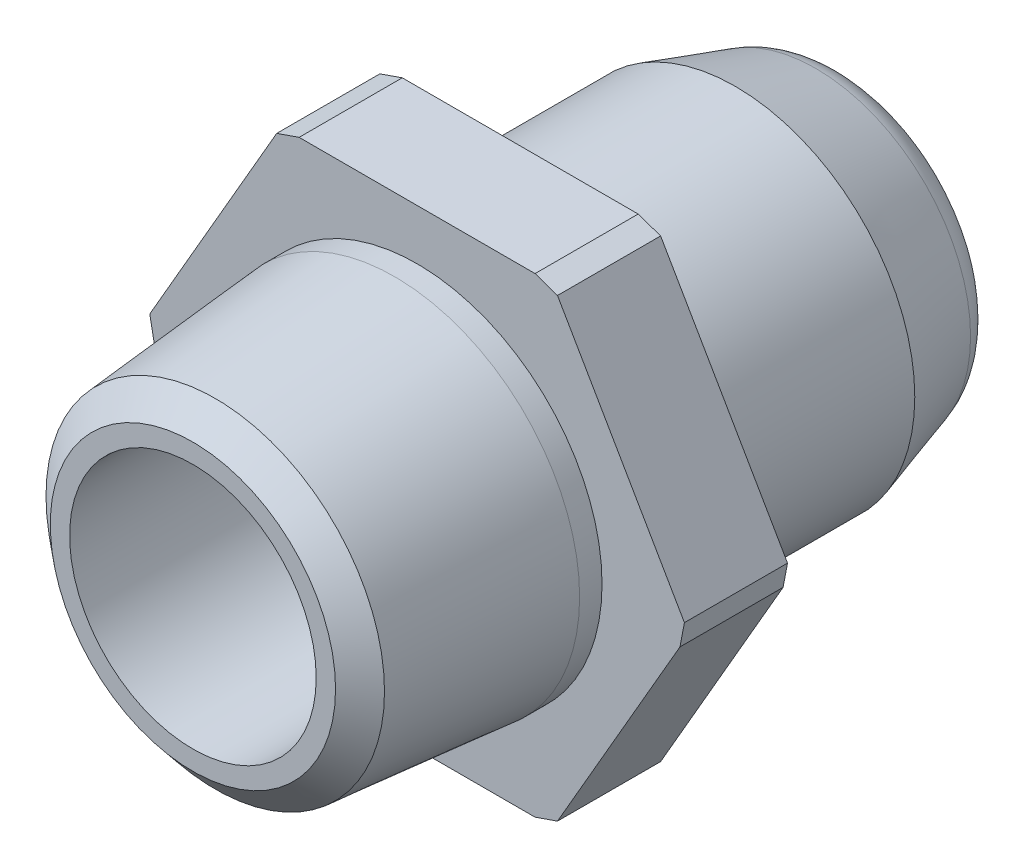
ISO-10303-21;
HEADER;
FILE_DESCRIPTION(('STEP AP214'),'2;1');
FILE_NAME('part.step','',(''),(''),'','','');
FILE_SCHEMA(('AUTOMOTIVE_DESIGN { 1 0 10303 214 1 1 1 1 }'));
ENDSEC;
DATA;
#1=APPLICATION_CONTEXT('core data for automotive mechanical design processes');
#2=APPLICATION_PROTOCOL_DEFINITION('international standard','automotive_design',2000,#1);
#3=PRODUCT_CONTEXT('',#1,'mechanical');
#4=PRODUCT('Part','Part','',(#3));
#5=PRODUCT_RELATED_PRODUCT_CATEGORY('part','',(#4));
#6=PRODUCT_DEFINITION_FORMATION('','',#4);
#7=PRODUCT_DEFINITION_CONTEXT('part definition',#1,'design');
#8=PRODUCT_DEFINITION('design','',#6,#7);
#9=PRODUCT_DEFINITION_SHAPE('','',#8);
#10=(LENGTH_UNIT() NAMED_UNIT(*) SI_UNIT(.MILLI.,.METRE.));
#11=(NAMED_UNIT(*) PLANE_ANGLE_UNIT() SI_UNIT($,.RADIAN.));
#12=(NAMED_UNIT(*) SI_UNIT($,.STERADIAN.) SOLID_ANGLE_UNIT());
#13=UNCERTAINTY_MEASURE_WITH_UNIT(LENGTH_MEASURE(1.E-05),#10,'distance_accuracy_value','');
#14=(GEOMETRIC_REPRESENTATION_CONTEXT(3) GLOBAL_UNCERTAINTY_ASSIGNED_CONTEXT((#13)) GLOBAL_UNIT_ASSIGNED_CONTEXT((#10,
#11,#12)) REPRESENTATION_CONTEXT('',''));
#15=CARTESIAN_POINT('',(0.,0.,0.));
#16=DIRECTION('',(0.,0.,1.));
#17=DIRECTION('',(1.,0.,0.));
#18=AXIS2_PLACEMENT_3D('',#15,#16,#17);
#19=CARTESIAN_POINT('',(15.3979316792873,0.,-2.921));
#20=DIRECTION('',(0.,0.,1.));
#21=DIRECTION('',(1.,0.,0.));
#22=AXIS2_PLACEMENT_3D('',#19,#20,#21);
#23=PLANE('',#22);
#24=DIRECTION('',(1.,0.,0.));
#25=VECTOR('',#24,1.);
#26=CARTESIAN_POINT('',(-7.69896583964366,-13.335,-2.921));
#27=LINE('',#26,#25);
#28=CARTESIAN_POINT('',(-7.19096583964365,-13.335,-2.921));
#29=VERTEX_POINT('',#28);
#30=CARTESIAN_POINT('',(6.68296583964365,-13.335,-2.921));
#31=VERTEX_POINT('',#30);
#32=EDGE_CURVE('E139',#29,#31,#27,.T.);
#33=ORIENTED_EDGE('',*,*,#32,.F.);
#34=DIRECTION('',(0.755928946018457,-0.654653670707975,0.));
#35=VECTOR('',#34,1.);
#36=CARTESIAN_POINT('',(-7.19096583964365,-13.335,-2.921));
#37=LINE('',#36,#35);
#38=CARTESIAN_POINT('',(-8.20696583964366,-12.455118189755,-2.921));
#39=VERTEX_POINT('',#38);
#40=EDGE_CURVE('E122',#29,#39,#37,.F.);
#41=ORIENTED_EDGE('',*,*,#40,.T.);
#42=DIRECTION('',(0.5,-0.866025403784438,0.));
#43=VECTOR('',#42,1.);
#44=CARTESIAN_POINT('',(-15.3979316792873,0.,-2.921));
#45=LINE('',#44,#43);
#46=CARTESIAN_POINT('',(-14.8899316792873,-0.879881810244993,-2.921));
#47=VERTEX_POINT('',#46);
#48=EDGE_CURVE('E150',#47,#39,#45,.T.);
#49=ORIENTED_EDGE('',*,*,#48,.F.);
#50=DIRECTION('',(0.18898223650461,-0.981980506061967,0.));
#51=VECTOR('',#50,1.);
#52=CARTESIAN_POINT('',(-14.8899316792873,-0.879881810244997,-2.921));
#53=LINE('',#52,#51);
#54=CARTESIAN_POINT('',(-15.1439316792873,0.439940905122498,-2.921));
#55=VERTEX_POINT('',#54);
#56=EDGE_CURVE('E133',#47,#55,#53,.F.);
#57=ORIENTED_EDGE('',*,*,#56,.T.);
#58=DIRECTION('',(-0.5,-0.866025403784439,0.));
#59=VECTOR('',#58,1.);
#60=CARTESIAN_POINT('',(-7.69896583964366,13.335,-2.921));
#61=LINE('',#60,#59);
#62=CARTESIAN_POINT('',(-7.95296583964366,12.8950590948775,-2.921));
#63=VERTEX_POINT('',#62);
#64=EDGE_CURVE('E155',#63,#55,#61,.T.);
#65=ORIENTED_EDGE('',*,*,#64,.F.);
#66=DIRECTION('',(-0.944911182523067,-0.327326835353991,0.));
#67=VECTOR('',#66,1.);
#68=CARTESIAN_POINT('',(-7.95296583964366,12.8950590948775,-2.921));
#69=LINE('',#68,#67);
#70=CARTESIAN_POINT('',(-6.68296583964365,13.335,-2.921));
#71=VERTEX_POINT('',#70);
#72=EDGE_CURVE('E143',#63,#71,#69,.F.);
#73=ORIENTED_EDGE('',*,*,#72,.T.);
#74=DIRECTION('',(-1.,0.,0.));
#75=VECTOR('',#74,1.);
#76=CARTESIAN_POINT('',(7.69896583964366,13.335,-2.921));
#77=LINE('',#76,#75);
#78=CARTESIAN_POINT('',(6.68296583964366,13.335,-2.921));
#79=VERTEX_POINT('',#78);
#80=EDGE_CURVE('E287',#79,#71,#77,.T.);
#81=ORIENTED_EDGE('',*,*,#80,.F.);
#82=DIRECTION('',(-0.944911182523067,0.327326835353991,0.));
#83=VECTOR('',#82,1.);
#84=CARTESIAN_POINT('',(6.68296583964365,13.335,-2.921));
#85=LINE('',#84,#83);
#86=CARTESIAN_POINT('',(7.95296583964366,12.8950590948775,-2.921));
#87=VERTEX_POINT('',#86);
#88=EDGE_CURVE('E180',#79,#87,#85,.F.);
#89=ORIENTED_EDGE('',*,*,#88,.T.);
#90=DIRECTION('',(-0.5,0.866025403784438,0.));
#91=VECTOR('',#90,1.);
#92=CARTESIAN_POINT('',(15.3979316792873,0.,-2.921));
#93=LINE('',#92,#91);
#94=CARTESIAN_POINT('',(15.1439316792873,0.439940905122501,-2.921));
#95=VERTEX_POINT('',#94);
#96=EDGE_CURVE('E282',#95,#87,#93,.T.);
#97=ORIENTED_EDGE('',*,*,#96,.F.);
#98=DIRECTION('',(0.188982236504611,0.981980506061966,0.));
#99=VECTOR('',#98,1.);
#100=CARTESIAN_POINT('',(15.1439316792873,0.439940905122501,-2.921));
#101=LINE('',#100,#99);
#102=CARTESIAN_POINT('',(14.8899316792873,-0.87988181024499,-2.921));
#103=VERTEX_POINT('',#102);
#104=EDGE_CURVE('E182',#95,#103,#101,.F.);
#105=ORIENTED_EDGE('',*,*,#104,.T.);
#106=DIRECTION('',(0.5,0.866025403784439,0.));
#107=VECTOR('',#106,1.);
#108=CARTESIAN_POINT('',(7.69896583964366,-13.335,-2.921));
#109=LINE('',#108,#107);
#110=CARTESIAN_POINT('',(7.95296583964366,-12.8950590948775,-2.921));
#111=VERTEX_POINT('',#110);
#112=EDGE_CURVE('E281',#111,#103,#109,.T.);
#113=ORIENTED_EDGE('',*,*,#112,.F.);
#114=DIRECTION('',(0.944911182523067,0.327326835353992,0.));
#115=VECTOR('',#114,1.);
#116=CARTESIAN_POINT('',(7.95296583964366,-12.8950590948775,-2.921));
#117=LINE('',#116,#115);
#118=EDGE_CURVE('E148',#111,#31,#117,.F.);
#119=ORIENTED_EDGE('',*,*,#118,.T.);
#120=EDGE_LOOP('',(#33,#41,#49,#57,#65,#73,#81,#89,#97,#105,#113,#119));
#121=FACE_BOUND('',#120,.T.);
#122=CARTESIAN_POINT('',(0.,0.,-2.921));
#123=DIRECTION('',(0.,0.,1.));
#124=DIRECTION('',(1.,0.,0.));
#125=AXIS2_PLACEMENT_3D('',#122,#123,#124);
#126=CIRCLE('',#125,10.16);
#127=CARTESIAN_POINT('',(10.16,0.,-2.921));
#128=VERTEX_POINT('',#127);
#129=EDGE_CURVE('E169',#128,#128,#126,.F.);
#130=ORIENTED_EDGE('',*,*,#129,.F.);
#131=EDGE_LOOP('',(#130));
#132=FACE_BOUND('',#131,.T.);
#133=ADVANCED_FACE('F31',(#121,#132),#23,.F.);
#134=CARTESIAN_POINT('',(15.3979316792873,0.,2.921));
#135=DIRECTION('',(0.,0.,1.));
#136=DIRECTION('',(1.,0.,0.));
#137=AXIS2_PLACEMENT_3D('',#134,#135,#136);
#138=PLANE('',#137);
#139=DIRECTION('',(0.5,-0.866025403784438,0.));
#140=VECTOR('',#139,1.);
#141=CARTESIAN_POINT('',(-15.3979316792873,0.,2.921));
#142=LINE('',#141,#140);
#143=CARTESIAN_POINT('',(-14.8899316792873,-0.879881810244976,2.921));
#144=VERTEX_POINT('',#143);
#145=CARTESIAN_POINT('',(-8.20696583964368,-12.455118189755,2.921));
#146=VERTEX_POINT('',#145);
#147=EDGE_CURVE('E165',#144,#146,#142,.T.);
#148=ORIENTED_EDGE('',*,*,#147,.T.);
#149=DIRECTION('',(-0.755928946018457,0.654653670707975,0.));
#150=VECTOR('',#149,1.);
#151=CARTESIAN_POINT('',(-0.882137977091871,-18.7986051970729,2.921));
#152=LINE('',#151,#150);
#153=CARTESIAN_POINT('',(-7.19096583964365,-13.335,2.921));
#154=VERTEX_POINT('',#153);
#155=EDGE_CURVE('E198',#146,#154,#152,.F.);
#156=ORIENTED_EDGE('',*,*,#155,.T.);
#157=DIRECTION('',(1.,0.,0.));
#158=VECTOR('',#157,1.);
#159=CARTESIAN_POINT('',(-7.69896583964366,-13.335,2.921));
#160=LINE('',#159,#158);
#161=CARTESIAN_POINT('',(6.68296583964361,-13.335,2.921));
#162=VERTEX_POINT('',#161);
#163=EDGE_CURVE('E142',#154,#162,#160,.T.);
#164=ORIENTED_EDGE('',*,*,#163,.T.);
#165=DIRECTION('',(-0.944911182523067,-0.327326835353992,0.));
#166=VECTOR('',#165,1.);
#167=CARTESIAN_POINT('',(18.5886313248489,-9.21075649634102,2.921));
#168=LINE('',#167,#166);
#169=CARTESIAN_POINT('',(7.95296583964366,-12.8950590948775,2.921));
#170=VERTEX_POINT('',#169);
#171=EDGE_CURVE('E194',#162,#170,#168,.F.);
#172=ORIENTED_EDGE('',*,*,#171,.T.);
#173=DIRECTION('',(0.5,0.866025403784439,0.));
#174=VECTOR('',#173,1.);
#175=CARTESIAN_POINT('',(7.69896583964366,-13.335,2.921));
#176=LINE('',#175,#174);
#177=CARTESIAN_POINT('',(14.8899316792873,-0.879881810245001,2.921));
#178=VERTEX_POINT('',#177);
#179=EDGE_CURVE('E149',#170,#178,#176,.T.);
#180=ORIENTED_EDGE('',*,*,#179,.T.);
#181=DIRECTION('',(-0.188982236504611,-0.981980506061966,0.));
#182=VECTOR('',#181,1.);
#183=CARTESIAN_POINT('',(15.0713602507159,0.0628487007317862,2.921));
#184=LINE('',#183,#182);
#185=CARTESIAN_POINT('',(15.1439316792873,0.439940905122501,2.921));
#186=VERTEX_POINT('',#185);
#187=EDGE_CURVE('E192',#178,#186,#184,.F.);
#188=ORIENTED_EDGE('',*,*,#187,.T.);
#189=DIRECTION('',(-0.5,0.866025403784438,0.));
#190=VECTOR('',#189,1.);
#191=CARTESIAN_POINT('',(15.3979316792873,0.,2.921));
#192=LINE('',#191,#190);
#193=CARTESIAN_POINT('',(7.95296583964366,12.8950590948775,2.921));
#194=VERTEX_POINT('',#193);
#195=EDGE_CURVE('E153',#186,#194,#192,.T.);
#196=ORIENTED_EDGE('',*,*,#195,.T.);
#197=DIRECTION('',(0.944911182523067,-0.327326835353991,0.));
#198=VECTOR('',#197,1.);
#199=CARTESIAN_POINT('',(18.5886313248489,9.21075649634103,2.921));
#200=LINE('',#199,#198);
#201=CARTESIAN_POINT('',(6.68296583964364,13.335,2.921));
#202=VERTEX_POINT('',#201);
#203=EDGE_CURVE('E190',#194,#202,#200,.F.);
#204=ORIENTED_EDGE('',*,*,#203,.T.);
#205=DIRECTION('',(-1.,0.,0.));
#206=VECTOR('',#205,1.);
#207=CARTESIAN_POINT('',(7.69896583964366,13.335,2.921));
#208=LINE('',#207,#206);
#209=CARTESIAN_POINT('',(-6.68296583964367,13.335,2.921));
#210=VERTEX_POINT('',#209);
#211=EDGE_CURVE('E161',#202,#210,#208,.T.);
#212=ORIENTED_EDGE('',*,*,#211,.T.);
#213=DIRECTION('',(0.944911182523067,0.327326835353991,0.));
#214=VECTOR('',#213,1.);
#215=CARTESIAN_POINT('',(8.90767524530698,18.7357564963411,2.921));
#216=LINE('',#215,#214);
#217=CARTESIAN_POINT('',(-7.95296583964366,12.8950590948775,2.921));
#218=VERTEX_POINT('',#217);
#219=EDGE_CURVE('E53',#210,#218,#216,.F.);
#220=ORIENTED_EDGE('',*,*,#219,.T.);
#221=DIRECTION('',(-0.5,-0.866025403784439,0.));
#222=VECTOR('',#221,1.);
#223=CARTESIAN_POINT('',(-7.69896583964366,13.335,2.921));
#224=LINE('',#223,#222);
#225=CARTESIAN_POINT('',(-15.1439316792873,0.439940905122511,2.921));
#226=VERTEX_POINT('',#225);
#227=EDGE_CURVE('E163',#218,#226,#224,.T.);
#228=ORIENTED_EDGE('',*,*,#227,.T.);
#229=DIRECTION('',(-0.18898223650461,0.981980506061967,0.));
#230=VECTOR('',#229,1.);
#231=CARTESIAN_POINT('',(-13.9715079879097,-5.65215129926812,2.921));
#232=LINE('',#231,#230);
#233=EDGE_CURVE('E196',#226,#144,#232,.F.);
#234=ORIENTED_EDGE('',*,*,#233,.T.);
#235=EDGE_LOOP('',(#148,#156,#164,#172,#180,#188,#196,#204,#212,#220,#228,#234));
#236=FACE_BOUND('',#235,.T.);
#237=CARTESIAN_POINT('',(0.,0.,2.921));
#238=DIRECTION('',(0.,0.,1.));
#239=DIRECTION('',(1.,0.,0.));
#240=AXIS2_PLACEMENT_3D('',#237,#238,#239);
#241=CIRCLE('',#240,10.4775);
#242=CARTESIAN_POINT('',(10.4775,0.,2.921));
#243=VERTEX_POINT('',#242);
#244=EDGE_CURVE('E290',#243,#243,#241,.T.);
#245=ORIENTED_EDGE('',*,*,#244,.F.);
#246=EDGE_LOOP('',(#245));
#247=FACE_BOUND('',#246,.T.);
#248=ADVANCED_FACE('F241',(#236,#247),#138,.T.);
#249=CARTESIAN_POINT('',(7.69896583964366,-13.335,2.921));
#250=DIRECTION('',(-0.866025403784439,0.5,0.));
#251=DIRECTION('',(-0.5,-0.866025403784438,0.));
#252=AXIS2_PLACEMENT_3D('',#249,#250,#251);
#253=PLANE('',#252);
#254=ORIENTED_EDGE('',*,*,#179,.F.);
#255=DIRECTION('',(0.,0.,-1.));
#256=VECTOR('',#255,1.);
#257=CARTESIAN_POINT('',(7.95296583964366,-12.8950590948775,2.921));
#258=LINE('',#257,#256);
#259=EDGE_CURVE('E206',#170,#111,#258,.T.);
#260=ORIENTED_EDGE('',*,*,#259,.T.);
#261=ORIENTED_EDGE('',*,*,#112,.T.);
#262=DIRECTION('',(0.,0.,1.));
#263=VECTOR('',#262,1.);
#264=CARTESIAN_POINT('',(14.8899316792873,-0.879881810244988,2.921));
#265=LINE('',#264,#263);
#266=EDGE_CURVE('E204',#103,#178,#265,.T.);
#267=ORIENTED_EDGE('',*,*,#266,.T.);
#268=EDGE_LOOP('',(#254,#260,#261,#267));
#269=FACE_BOUND('',#268,.T.);
#270=ADVANCED_FACE('F33',(#269),#253,.F.);
#271=CARTESIAN_POINT('',(15.3979316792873,0.,2.921));
#272=DIRECTION('',(-0.866025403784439,-0.5,0.));
#273=DIRECTION('',(0.5,-0.866025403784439,0.));
#274=AXIS2_PLACEMENT_3D('',#271,#272,#273);
#275=PLANE('',#274);
#276=ORIENTED_EDGE('',*,*,#195,.F.);
#277=DIRECTION('',(0.,0.,-1.));
#278=VECTOR('',#277,1.);
#279=CARTESIAN_POINT('',(15.1439316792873,0.439940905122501,2.921));
#280=LINE('',#279,#278);
#281=EDGE_CURVE('E211',#186,#95,#280,.T.);
#282=ORIENTED_EDGE('',*,*,#281,.T.);
#283=ORIENTED_EDGE('',*,*,#96,.T.);
#284=DIRECTION('',(0.,0.,1.));
#285=VECTOR('',#284,1.);
#286=CARTESIAN_POINT('',(7.95296583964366,12.8950590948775,2.921));
#287=LINE('',#286,#285);
#288=EDGE_CURVE('E209',#87,#194,#287,.T.);
#289=ORIENTED_EDGE('',*,*,#288,.T.);
#290=EDGE_LOOP('',(#276,#282,#283,#289));
#291=FACE_BOUND('',#290,.T.);
#292=ADVANCED_FACE('F262',(#291),#275,.F.);
#293=CARTESIAN_POINT('',(7.69896583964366,13.335,2.921));
#294=DIRECTION('',(0.,-1.,0.));
#295=DIRECTION('',(1.,0.,0.));
#296=AXIS2_PLACEMENT_3D('',#293,#294,#295);
#297=PLANE('',#296);
#298=ORIENTED_EDGE('',*,*,#211,.F.);
#299=DIRECTION('',(0.,0.,-1.));
#300=VECTOR('',#299,1.);
#301=CARTESIAN_POINT('',(6.68296583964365,13.335,2.921));
#302=LINE('',#301,#300);
#303=EDGE_CURVE('E216',#202,#79,#302,.T.);
#304=ORIENTED_EDGE('',*,*,#303,.T.);
#305=ORIENTED_EDGE('',*,*,#80,.T.);
#306=DIRECTION('',(0.,0.,1.));
#307=VECTOR('',#306,1.);
#308=CARTESIAN_POINT('',(-6.68296583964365,13.335,2.921));
#309=LINE('',#308,#307);
#310=EDGE_CURVE('E214',#71,#210,#309,.T.);
#311=ORIENTED_EDGE('',*,*,#310,.T.);
#312=EDGE_LOOP('',(#298,#304,#305,#311));
#313=FACE_BOUND('',#312,.T.);
#314=ADVANCED_FACE('F260',(#313),#297,.F.);
#315=CARTESIAN_POINT('',(-7.69896583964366,13.335,2.921));
#316=DIRECTION('',(0.866025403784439,-0.5,0.));
#317=DIRECTION('',(0.5,0.866025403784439,0.));
#318=AXIS2_PLACEMENT_3D('',#315,#316,#317);
#319=PLANE('',#318);
#320=ORIENTED_EDGE('',*,*,#64,.T.);
#321=DIRECTION('',(0.,0.,1.));
#322=VECTOR('',#321,1.);
#323=CARTESIAN_POINT('',(-15.1439316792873,0.439940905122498,2.921));
#324=LINE('',#323,#322);
#325=EDGE_CURVE('E46',#55,#226,#324,.T.);
#326=ORIENTED_EDGE('',*,*,#325,.T.);
#327=ORIENTED_EDGE('',*,*,#227,.F.);
#328=DIRECTION('',(0.,0.,-1.));
#329=VECTOR('',#328,1.);
#330=CARTESIAN_POINT('',(-7.95296583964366,12.8950590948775,2.921));
#331=LINE('',#330,#329);
#332=EDGE_CURVE('E200',#218,#63,#331,.T.);
#333=ORIENTED_EDGE('',*,*,#332,.T.);
#334=EDGE_LOOP('',(#320,#326,#327,#333));
#335=FACE_BOUND('',#334,.T.);
#336=ADVANCED_FACE('F256',(#335),#319,.F.);
#337=CARTESIAN_POINT('',(-15.3979316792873,0.,2.921));
#338=DIRECTION('',(0.866025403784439,0.5,0.));
#339=DIRECTION('',(-0.5,0.866025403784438,0.));
#340=AXIS2_PLACEMENT_3D('',#337,#338,#339);
#341=PLANE('',#340);
#342=ORIENTED_EDGE('',*,*,#48,.T.);
#343=DIRECTION('',(0.,0.,1.));
#344=VECTOR('',#343,1.);
#345=CARTESIAN_POINT('',(-8.20696583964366,-12.455118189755,2.921));
#346=LINE('',#345,#344);
#347=EDGE_CURVE('E127',#39,#146,#346,.T.);
#348=ORIENTED_EDGE('',*,*,#347,.T.);
#349=ORIENTED_EDGE('',*,*,#147,.F.);
#350=DIRECTION('',(0.,0.,-1.));
#351=VECTOR('',#350,1.);
#352=CARTESIAN_POINT('',(-14.8899316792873,-0.879881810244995,2.921));
#353=LINE('',#352,#351);
#354=EDGE_CURVE('E132',#144,#47,#353,.T.);
#355=ORIENTED_EDGE('',*,*,#354,.T.);
#356=EDGE_LOOP('',(#342,#348,#349,#355));
#357=FACE_BOUND('',#356,.T.);
#358=ADVANCED_FACE('F253',(#357),#341,.F.);
#359=CARTESIAN_POINT('',(-7.69896583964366,-13.335,2.921));
#360=DIRECTION('',(0.,1.,0.));
#361=DIRECTION('',(0.,0.,1.));
#362=AXIS2_PLACEMENT_3D('',#359,#360,#361);
#363=PLANE('',#362);
#364=ORIENTED_EDGE('',*,*,#163,.F.);
#365=DIRECTION('',(0.,0.,-1.));
#366=VECTOR('',#365,1.);
#367=CARTESIAN_POINT('',(-7.19096583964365,-13.335,2.921));
#368=LINE('',#367,#366);
#369=EDGE_CURVE('E126',#154,#29,#368,.T.);
#370=ORIENTED_EDGE('',*,*,#369,.T.);
#371=ORIENTED_EDGE('',*,*,#32,.T.);
#372=DIRECTION('',(0.,0.,1.));
#373=VECTOR('',#372,1.);
#374=CARTESIAN_POINT('',(6.68296583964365,-13.335,2.921));
#375=LINE('',#374,#373);
#376=EDGE_CURVE('E144',#31,#162,#375,.T.);
#377=ORIENTED_EDGE('',*,*,#376,.T.);
#378=EDGE_LOOP('',(#364,#370,#371,#377));
#379=FACE_BOUND('',#378,.T.);
#380=ADVANCED_FACE('F138',(#379),#363,.F.);
#381=CARTESIAN_POINT('',(0.,0.,4.191));
#382=DIRECTION('',(0.,0.,-1.));
#383=DIRECTION('',(-1.,0.,0.));
#384=AXIS2_PLACEMENT_3D('',#381,#382,#383);
#385=CYLINDRICAL_SURFACE('',#384,10.4775);
#386=CARTESIAN_POINT('',(0.,0.,4.191));
#387=DIRECTION('',(0.,0.,1.));
#388=DIRECTION('',(1.,0.,0.));
#389=AXIS2_PLACEMENT_3D('',#386,#387,#388);
#390=CIRCLE('',#389,10.4775);
#391=CARTESIAN_POINT('',(10.4775,0.,4.191));
#392=VERTEX_POINT('',#391);
#393=EDGE_CURVE('E285',#392,#392,#390,.T.);
#394=ORIENTED_EDGE('',*,*,#393,.F.);
#395=EDGE_LOOP('',(#394));
#396=FACE_BOUND('',#395,.T.);
#397=ORIENTED_EDGE('',*,*,#244,.T.);
#398=EDGE_LOOP('',(#397));
#399=FACE_BOUND('',#398,.T.);
#400=ADVANCED_FACE('F248',(#396,#399),#385,.T.);
#401=CARTESIAN_POINT('',(0.,0.,4.191));
#402=DIRECTION('',(0.,0.,-1.));
#403=DIRECTION('',(1.,0.,0.));
#404=AXIS2_PLACEMENT_3D('',#401,#402,#403);
#405=CONICAL_SURFACE('',#404,10.4775,0.0872664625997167);
#406=CARTESIAN_POINT('',(0.,0.,14.3558327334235));
#407=DIRECTION('',(0.,0.,-1.));
#408=DIRECTION('',(-1.,0.,0.));
#409=AXIS2_PLACEMENT_3D('',#406,#407,#408);
#410=CIRCLE('',#409,9.58819236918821);
#411=CARTESIAN_POINT('',(-9.58819236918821,0.,14.3558327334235));
#412=VERTEX_POINT('',#411);
#413=EDGE_CURVE('E11',#412,#412,#410,.T.);
#414=ORIENTED_EDGE('',*,*,#413,.T.);
#415=EDGE_LOOP('',(#414));
#416=FACE_BOUND('',#415,.T.);
#417=ORIENTED_EDGE('',*,*,#393,.T.);
#418=EDGE_LOOP('',(#417));
#419=FACE_BOUND('',#418,.T.);
#420=ADVANCED_FACE('F340',(#416,#419),#405,.T.);
#421=CARTESIAN_POINT('',(0.,0.,15.621));
#422=DIRECTION('',(0.,0.,1.));
#423=DIRECTION('',(1.,0.,0.));
#424=AXIS2_PLACEMENT_3D('',#421,#422,#423);
#425=PLANE('',#424);
#426=CARTESIAN_POINT('',(0.,0.,15.621));
#427=DIRECTION('',(0.,0.,1.));
#428=DIRECTION('',(1.,0.,0.));
#429=AXIS2_PLACEMENT_3D('',#426,#427,#428);
#430=CIRCLE('',#429,6.985);
#431=CARTESIAN_POINT('',(6.985,0.,15.621));
#432=VERTEX_POINT('',#431);
#433=EDGE_CURVE('E360',#432,#432,#430,.T.);
#434=ORIENTED_EDGE('',*,*,#433,.F.);
#435=EDGE_LOOP('',(#434));
#436=FACE_BOUND('',#435,.T.);
#437=CARTESIAN_POINT('',(0.,0.,15.621));
#438=DIRECTION('',(0.,0.,1.));
#439=DIRECTION('',(1.,0.,0.));
#440=AXIS2_PLACEMENT_3D('',#437,#438,#439);
#441=CIRCLE('',#440,8.08042473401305);
#442=CARTESIAN_POINT('',(8.08042473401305,0.,15.621));
#443=VERTEX_POINT('',#442);
#444=EDGE_CURVE('E39',#443,#443,#441,.T.);
#445=ORIENTED_EDGE('',*,*,#444,.T.);
#446=EDGE_LOOP('',(#445));
#447=FACE_BOUND('',#446,.T.);
#448=ADVANCED_FACE('F221',(#436,#447),#425,.T.);
#449=CARTESIAN_POINT('',(0.,0.,-15.113));
#450=DIRECTION('',(0.,0.,1.));
#451=DIRECTION('',(1.,0.,0.));
#452=AXIS2_PLACEMENT_3D('',#449,#450,#451);
#453=CYLINDRICAL_SURFACE('',#452,10.16);
#454=CARTESIAN_POINT('',(0.,0.,-15.113));
#455=DIRECTION('',(0.,0.,-1.));
#456=DIRECTION('',(-1.,0.,0.));
#457=AXIS2_PLACEMENT_3D('',#454,#455,#456);
#458=CIRCLE('',#457,10.16);
#459=CARTESIAN_POINT('',(10.16,0.,-15.113));
#460=VERTEX_POINT('',#459);
#461=EDGE_CURVE('E353',#460,#460,#458,.T.);
#462=CARTESIAN_POINT('',(10.16,0.,-15.113));
#463=CARTESIAN_POINT('',(10.16,0.,-14.986));
#464=CARTESIAN_POINT('',(10.16,0.,-14.859));
#465=CARTESIAN_POINT('',(10.16,0.,-14.605));
#466=CARTESIAN_POINT('',(10.16,0.,-14.478));
#467=CARTESIAN_POINT('',(10.16,0.,-14.224));
#468=CARTESIAN_POINT('',(10.16,0.,-14.097));
#469=CARTESIAN_POINT('',(10.16,0.,-13.843));
#470=CARTESIAN_POINT('',(10.16,0.,-13.716));
#471=CARTESIAN_POINT('',(10.16,0.,-13.462));
#472=CARTESIAN_POINT('',(10.16,0.,-13.335));
#473=CARTESIAN_POINT('',(10.16,0.,-13.081));
#474=CARTESIAN_POINT('',(10.16,0.,-12.954));
#475=CARTESIAN_POINT('',(10.16,0.,-12.7));
#476=CARTESIAN_POINT('',(10.16,0.,-12.573));
#477=CARTESIAN_POINT('',(10.16,0.,-12.319));
#478=CARTESIAN_POINT('',(10.16,0.,-12.192));
#479=CARTESIAN_POINT('',(10.16,0.,-11.938));
#480=CARTESIAN_POINT('',(10.16,0.,-11.811));
#481=CARTESIAN_POINT('',(10.16,0.,-11.557));
#482=CARTESIAN_POINT('',(10.16,0.,-11.43));
#483=CARTESIAN_POINT('',(10.16,0.,-11.176));
#484=CARTESIAN_POINT('',(10.16,0.,-11.049));
#485=CARTESIAN_POINT('',(10.16,0.,-10.795));
#486=CARTESIAN_POINT('',(10.16,0.,-10.668));
#487=CARTESIAN_POINT('',(10.16,0.,-10.414));
#488=CARTESIAN_POINT('',(10.16,0.,-10.287));
#489=CARTESIAN_POINT('',(10.16,0.,-10.033));
#490=CARTESIAN_POINT('',(10.16,0.,-9.906));
#491=CARTESIAN_POINT('',(10.16,0.,-9.652));
#492=CARTESIAN_POINT('',(10.16,0.,-9.525));
#493=CARTESIAN_POINT('',(10.16,0.,-9.271));
#494=CARTESIAN_POINT('',(10.16,0.,-9.144));
#495=CARTESIAN_POINT('',(10.16,0.,-8.89));
#496=CARTESIAN_POINT('',(10.16,0.,-8.763));
#497=CARTESIAN_POINT('',(10.16,0.,-8.509));
#498=CARTESIAN_POINT('',(10.16,0.,-8.382));
#499=CARTESIAN_POINT('',(10.16,0.,-8.128));
#500=CARTESIAN_POINT('',(10.16,0.,-8.001));
#501=CARTESIAN_POINT('',(10.16,0.,-7.747));
#502=CARTESIAN_POINT('',(10.16,0.,-7.62));
#503=CARTESIAN_POINT('',(10.16,0.,-7.366));
#504=CARTESIAN_POINT('',(10.16,0.,-7.239));
#505=CARTESIAN_POINT('',(10.16,0.,-6.985));
#506=CARTESIAN_POINT('',(10.16,0.,-6.858));
#507=CARTESIAN_POINT('',(10.16,0.,-6.604));
#508=CARTESIAN_POINT('',(10.16,0.,-6.477));
#509=CARTESIAN_POINT('',(10.16,0.,-6.223));
#510=CARTESIAN_POINT('',(10.16,0.,-6.096));
#511=CARTESIAN_POINT('',(10.16,0.,-5.842));
#512=CARTESIAN_POINT('',(10.16,0.,-5.715));
#513=CARTESIAN_POINT('',(10.16,0.,-5.461));
#514=CARTESIAN_POINT('',(10.16,0.,-5.334));
#515=CARTESIAN_POINT('',(10.16,0.,-5.08));
#516=CARTESIAN_POINT('',(10.16,0.,-4.953));
#517=CARTESIAN_POINT('',(10.16,0.,-4.699));
#518=CARTESIAN_POINT('',(10.16,0.,-4.572));
#519=CARTESIAN_POINT('',(10.16,0.,-4.318));
#520=CARTESIAN_POINT('',(10.16,0.,-4.191));
#521=CARTESIAN_POINT('',(10.16,0.,-3.937));
#522=CARTESIAN_POINT('',(10.16,0.,-3.81));
#523=CARTESIAN_POINT('',(10.16,0.,-3.556));
#524=CARTESIAN_POINT('',(10.16,0.,-3.429));
#525=CARTESIAN_POINT('',(10.16,0.,-3.175));
#526=CARTESIAN_POINT('',(10.16,0.,-3.048));
#527=CARTESIAN_POINT('',(10.16,0.,-2.921));
#528=B_SPLINE_CURVE_WITH_KNOTS('',3,(#462,#463,#464,#465,#466,#467,#468,#469,#470,#471,#472,
#473,#474,#475,#476,#477,#478,#479,#480,#481,#482,#483,#484,#485,#486,#487,#488,#489,#490,#491,
#492,#493,#494,#495,#496,#497,#498,#499,#500,#501,#502,#503,#504,#505,#506,#507,#508,#509,#510,
#511,#512,#513,#514,#515,#516,#517,#518,#519,#520,#521,#522,#523,#524,#525,#526,#527),
.UNSPECIFIED.,.F.,.F.,(4,2,2,2,2,2,2,2,2,2,2,2,2,2,2,2,2,2,2,2,2,2,2,2,2,2,2,2,2,2,2,2,4),(0.,
0.380999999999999,0.761999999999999,1.143,1.524,1.905,2.286,2.667,3.048,3.429,3.81,4.191,4.572,
4.953,5.334,5.715,6.096,6.477,6.858,7.239,7.62,8.001,8.382,8.763,9.144,9.525,9.906,10.287,
10.668,11.049,11.43,11.811,12.192),.UNSPECIFIED.);
#529=EDGE_CURVE('BSEAM334',#460,#128,#528,.T.);
#530=ORIENTED_EDGE('',*,*,#461,.F.);
#531=ORIENTED_EDGE('',*,*,#129,.T.);
#532=ORIENTED_EDGE('',*,*,#529,.T.);
#533=ORIENTED_EDGE('',*,*,#529,.F.);
#534=EDGE_LOOP('',(#530,#532,#531,#533));
#535=FACE_BOUND('',#534,.T.);
#536=ADVANCED_FACE('F334',(#535),#453,.T.);
#537=CARTESIAN_POINT('',(0.,0.,-15.113));
#538=DIRECTION('',(0.,0.,1.));
#539=DIRECTION('',(-1.,0.,0.));
#540=AXIS2_PLACEMENT_3D('',#537,#538,#539);
#541=CONICAL_SURFACE('',#540,10.16,0.296705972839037);
#542=CARTESIAN_POINT('',(0.,0.,-19.6656241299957));
#543=DIRECTION('',(0.,0.,1.));
#544=DIRECTION('',(1.,0.,0.));
#545=AXIS2_PLACEMENT_3D('',#542,#543,#544);
#546=CIRCLE('',#545,8.76812312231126);
#547=CARTESIAN_POINT('',(8.76812312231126,0.,-19.6656241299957));
#548=VERTEX_POINT('',#547);
#549=EDGE_CURVE('E175',#548,#548,#546,.T.);
#550=ORIENTED_EDGE('',*,*,#549,.T.);
#551=EDGE_LOOP('',(#550));
#552=FACE_BOUND('',#551,.T.);
#553=ORIENTED_EDGE('',*,*,#461,.T.);
#554=EDGE_LOOP('',(#553));
#555=FACE_BOUND('',#554,.T.);
#556=ADVANCED_FACE('F330',(#552,#555),#541,.T.);
#557=CARTESIAN_POINT('',(0.,0.,-21.463));
#558=DIRECTION('',(0.,0.,-1.));
#559=DIRECTION('',(-1.,0.,0.));
#560=AXIS2_PLACEMENT_3D('',#557,#558,#559);
#561=PLANE('',#560);
#562=CARTESIAN_POINT('',(0.,0.,-21.463));
#563=DIRECTION('',(0.,0.,1.));
#564=DIRECTION('',(1.,0.,0.));
#565=AXIS2_PLACEMENT_3D('',#562,#563,#564);
#566=CIRCLE('',#565,6.096);
#567=CARTESIAN_POINT('',(6.096,0.,-21.463));
#568=VERTEX_POINT('',#567);
#569=EDGE_CURVE('E363',#568,#568,#566,.T.);
#570=ORIENTED_EDGE('',*,*,#569,.T.);
#571=EDGE_LOOP('',(#570));
#572=FACE_BOUND('',#571,.T.);
#573=CARTESIAN_POINT('',(0.,0.,-21.463));
#574=DIRECTION('',(0.,0.,-1.));
#575=DIRECTION('',(-1.,0.,0.));
#576=AXIS2_PLACEMENT_3D('',#573,#574,#575);
#577=CIRCLE('',#576,6.33910904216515);
#578=CARTESIAN_POINT('',(-6.33910904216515,0.,-21.463));
#579=VERTEX_POINT('',#578);
#580=EDGE_CURVE('E172',#579,#579,#577,.T.);
#581=ORIENTED_EDGE('',*,*,#580,.T.);
#582=EDGE_LOOP('',(#581));
#583=FACE_BOUND('',#582,.T.);
#584=ADVANCED_FACE('F326',(#572,#583),#561,.T.);
#585=CARTESIAN_POINT('',(0.,0.,-18.923));
#586=DIRECTION('',(0.,0.,-1.));
#587=DIRECTION('',(-1.,0.,0.));
#588=AXIS2_PLACEMENT_3D('',#585,#586,#587);
#589=TOROIDAL_SURFACE('',#588,6.33910904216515,2.54);
#590=ORIENTED_EDGE('',*,*,#549,.F.);
#591=EDGE_LOOP('',(#590));
#592=FACE_BOUND('',#591,.T.);
#593=ORIENTED_EDGE('',*,*,#580,.F.);
#594=EDGE_LOOP('',(#593));
#595=FACE_BOUND('',#594,.T.);
#596=ADVANCED_FACE('F323',(#592,#595),#589,.T.);
#597=CARTESIAN_POINT('',(-7.19096583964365,-13.335,2.921));
#598=DIRECTION('',(0.654653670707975,0.755928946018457,0.));
#599=DIRECTION('',(-0.755928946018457,0.654653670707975,0.));
#600=AXIS2_PLACEMENT_3D('',#597,#598,#599);
#601=PLANE('',#600);
#602=ORIENTED_EDGE('',*,*,#155,.F.);
#603=ORIENTED_EDGE('',*,*,#347,.F.);
#604=ORIENTED_EDGE('',*,*,#40,.F.);
#605=ORIENTED_EDGE('',*,*,#369,.F.);
#606=EDGE_LOOP('',(#602,#603,#604,#605));
#607=FACE_BOUND('',#606,.T.);
#608=ADVANCED_FACE('F125',(#607),#601,.F.);
#609=CARTESIAN_POINT('',(-14.8899316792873,-0.879881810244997,2.921));
#610=DIRECTION('',(0.981980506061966,0.18898223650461,0.));
#611=DIRECTION('',(-0.18898223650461,0.981980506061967,0.));
#612=AXIS2_PLACEMENT_3D('',#609,#610,#611);
#613=PLANE('',#612);
#614=ORIENTED_EDGE('',*,*,#233,.F.);
#615=ORIENTED_EDGE('',*,*,#325,.F.);
#616=ORIENTED_EDGE('',*,*,#56,.F.);
#617=ORIENTED_EDGE('',*,*,#354,.F.);
#618=EDGE_LOOP('',(#614,#615,#616,#617));
#619=FACE_BOUND('',#618,.T.);
#620=ADVANCED_FACE('F299',(#619),#613,.F.);
#621=CARTESIAN_POINT('',(7.95296583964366,-12.8950590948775,2.921));
#622=DIRECTION('',(-0.327326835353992,0.944911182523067,0.));
#623=DIRECTION('',(-0.944911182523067,-0.327326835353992,0.));
#624=AXIS2_PLACEMENT_3D('',#621,#622,#623);
#625=PLANE('',#624);
#626=ORIENTED_EDGE('',*,*,#171,.F.);
#627=ORIENTED_EDGE('',*,*,#376,.F.);
#628=ORIENTED_EDGE('',*,*,#118,.F.);
#629=ORIENTED_EDGE('',*,*,#259,.F.);
#630=EDGE_LOOP('',(#626,#627,#628,#629));
#631=FACE_BOUND('',#630,.T.);
#632=ADVANCED_FACE('F313',(#631),#625,.F.);
#633=CARTESIAN_POINT('',(15.1439316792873,0.439940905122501,2.921));
#634=DIRECTION('',(-0.981980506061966,0.188982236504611,0.));
#635=DIRECTION('',(-0.188982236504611,-0.981980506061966,0.));
#636=AXIS2_PLACEMENT_3D('',#633,#634,#635);
#637=PLANE('',#636);
#638=ORIENTED_EDGE('',*,*,#187,.F.);
#639=ORIENTED_EDGE('',*,*,#266,.F.);
#640=ORIENTED_EDGE('',*,*,#104,.F.);
#641=ORIENTED_EDGE('',*,*,#281,.F.);
#642=EDGE_LOOP('',(#638,#639,#640,#641));
#643=FACE_BOUND('',#642,.T.);
#644=ADVANCED_FACE('F278',(#643),#637,.F.);
#645=CARTESIAN_POINT('',(6.68296583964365,13.335,2.921));
#646=DIRECTION('',(-0.327326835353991,-0.944911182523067,0.));
#647=DIRECTION('',(0.944911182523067,-0.327326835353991,0.));
#648=AXIS2_PLACEMENT_3D('',#645,#646,#647);
#649=PLANE('',#648);
#650=ORIENTED_EDGE('',*,*,#203,.F.);
#651=ORIENTED_EDGE('',*,*,#288,.F.);
#652=ORIENTED_EDGE('',*,*,#88,.F.);
#653=ORIENTED_EDGE('',*,*,#303,.F.);
#654=EDGE_LOOP('',(#650,#651,#652,#653));
#655=FACE_BOUND('',#654,.T.);
#656=ADVANCED_FACE('F236',(#655),#649,.F.);
#657=CARTESIAN_POINT('',(-7.95296583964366,12.8950590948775,2.921));
#658=DIRECTION('',(0.327326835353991,-0.944911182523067,0.));
#659=DIRECTION('',(0.944911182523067,0.327326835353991,0.));
#660=AXIS2_PLACEMENT_3D('',#657,#658,#659);
#661=PLANE('',#660);
#662=ORIENTED_EDGE('',*,*,#219,.F.);
#663=ORIENTED_EDGE('',*,*,#310,.F.);
#664=ORIENTED_EDGE('',*,*,#72,.F.);
#665=ORIENTED_EDGE('',*,*,#332,.F.);
#666=EDGE_LOOP('',(#662,#663,#664,#665));
#667=FACE_BOUND('',#666,.T.);
#668=ADVANCED_FACE('F226',(#667),#661,.F.);
#669=CARTESIAN_POINT('',(0.,0.,15.621));
#670=DIRECTION('',(0.,0.,-1.));
#671=DIRECTION('',(-1.,0.,0.));
#672=AXIS2_PLACEMENT_3D('',#669,#670,#671);
#673=CONICAL_SURFACE('',#672,8.08042473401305,0.872664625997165);
#674=ORIENTED_EDGE('',*,*,#413,.F.);
#675=EDGE_LOOP('',(#674));
#676=FACE_BOUND('',#675,.T.);
#677=ORIENTED_EDGE('',*,*,#444,.F.);
#678=EDGE_LOOP('',(#677));
#679=FACE_BOUND('',#678,.T.);
#680=ADVANCED_FACE('F223',(#676,#679),#673,.T.);
#681=CARTESIAN_POINT('',(0.,0.,2.921));
#682=DIRECTION('',(0.,0.,1.));
#683=DIRECTION('',(1.,0.,0.));
#684=AXIS2_PLACEMENT_3D('',#681,#682,#683);
#685=CYLINDRICAL_SURFACE('',#684,6.985);
#686=CARTESIAN_POINT('',(0.,0.,2.921));
#687=DIRECTION('',(0.,0.,1.));
#688=DIRECTION('',(1.,0.,0.));
#689=AXIS2_PLACEMENT_3D('',#686,#687,#688);
#690=CIRCLE('',#689,6.985);
#691=CARTESIAN_POINT('',(6.985,0.,2.921));
#692=VERTEX_POINT('',#691);
#693=EDGE_CURVE('E355',#692,#692,#690,.T.);
#694=ORIENTED_EDGE('',*,*,#693,.F.);
#695=EDGE_LOOP('',(#694));
#696=FACE_BOUND('',#695,.T.);
#697=ORIENTED_EDGE('',*,*,#433,.T.);
#698=EDGE_LOOP('',(#697));
#699=FACE_BOUND('',#698,.T.);
#700=ADVANCED_FACE('F225',(#696,#699),#685,.F.);
#701=CARTESIAN_POINT('',(0.,0.,2.921));
#702=DIRECTION('',(0.,0.,1.));
#703=DIRECTION('',(1.,0.,0.));
#704=AXIS2_PLACEMENT_3D('',#701,#702,#703);
#705=PLANE('',#704);
#706=CARTESIAN_POINT('',(0.,0.,2.921));
#707=DIRECTION('',(0.,0.,1.));
#708=DIRECTION('',(1.,0.,0.));
#709=AXIS2_PLACEMENT_3D('',#706,#707,#708);
#710=CIRCLE('',#709,6.096);
#711=CARTESIAN_POINT('',(6.096,0.,2.921));
#712=VERTEX_POINT('',#711);
#713=EDGE_CURVE('E366',#712,#712,#710,.T.);
#714=ORIENTED_EDGE('',*,*,#713,.F.);
#715=EDGE_LOOP('',(#714));
#716=FACE_BOUND('',#715,.T.);
#717=ORIENTED_EDGE('',*,*,#693,.T.);
#718=EDGE_LOOP('',(#717));
#719=FACE_BOUND('',#718,.T.);
#720=ADVANCED_FACE('F233',(#716,#719),#705,.T.);
#721=CARTESIAN_POINT('',(0.,0.,-21.463));
#722=DIRECTION('',(0.,0.,1.));
#723=DIRECTION('',(1.,0.,0.));
#724=AXIS2_PLACEMENT_3D('',#721,#722,#723);
#725=CYLINDRICAL_SURFACE('',#724,6.096);
#726=CARTESIAN_POINT('',(6.096,0.,-21.463));
#727=CARTESIAN_POINT('',(6.096,0.,-21.209));
#728=CARTESIAN_POINT('',(6.096,0.,-20.955));
#729=CARTESIAN_POINT('',(6.096,0.,-20.447));
#730=CARTESIAN_POINT('',(6.096,0.,-20.193));
#731=CARTESIAN_POINT('',(6.096,0.,-19.685));
#732=CARTESIAN_POINT('',(6.096,0.,-19.431));
#733=CARTESIAN_POINT('',(6.096,0.,-18.923));
#734=CARTESIAN_POINT('',(6.096,0.,-18.669));
#735=CARTESIAN_POINT('',(6.096,0.,-18.161));
#736=CARTESIAN_POINT('',(6.096,0.,-17.907));
#737=CARTESIAN_POINT('',(6.096,0.,-17.399));
#738=CARTESIAN_POINT('',(6.096,0.,-17.145));
#739=CARTESIAN_POINT('',(6.096,0.,-16.637));
#740=CARTESIAN_POINT('',(6.096,0.,-16.383));
#741=CARTESIAN_POINT('',(6.096,0.,-15.875));
#742=CARTESIAN_POINT('',(6.096,0.,-15.621));
#743=CARTESIAN_POINT('',(6.096,0.,-15.113));
#744=CARTESIAN_POINT('',(6.096,0.,-14.859));
#745=CARTESIAN_POINT('',(6.096,0.,-14.351));
#746=CARTESIAN_POINT('',(6.096,0.,-14.097));
#747=CARTESIAN_POINT('',(6.096,0.,-13.589));
#748=CARTESIAN_POINT('',(6.096,0.,-13.335));
#749=CARTESIAN_POINT('',(6.096,0.,-12.827));
#750=CARTESIAN_POINT('',(6.096,0.,-12.573));
#751=CARTESIAN_POINT('',(6.096,0.,-12.065));
#752=CARTESIAN_POINT('',(6.096,0.,-11.811));
#753=CARTESIAN_POINT('',(6.096,0.,-11.303));
#754=CARTESIAN_POINT('',(6.096,0.,-11.049));
#755=CARTESIAN_POINT('',(6.096,0.,-10.541));
#756=CARTESIAN_POINT('',(6.096,0.,-10.287));
#757=CARTESIAN_POINT('',(6.096,0.,-9.779));
#758=CARTESIAN_POINT('',(6.096,0.,-9.525));
#759=CARTESIAN_POINT('',(6.096,0.,-9.017));
#760=CARTESIAN_POINT('',(6.096,0.,-8.763));
#761=CARTESIAN_POINT('',(6.096,0.,-8.255));
#762=CARTESIAN_POINT('',(6.096,0.,-8.001));
#763=CARTESIAN_POINT('',(6.096,0.,-7.493));
#764=CARTESIAN_POINT('',(6.096,0.,-7.239));
#765=CARTESIAN_POINT('',(6.096,0.,-6.731));
#766=CARTESIAN_POINT('',(6.096,0.,-6.477));
#767=CARTESIAN_POINT('',(6.096,0.,-5.969));
#768=CARTESIAN_POINT('',(6.096,0.,-5.715));
#769=CARTESIAN_POINT('',(6.096,0.,-5.207));
#770=CARTESIAN_POINT('',(6.096,0.,-4.953));
#771=CARTESIAN_POINT('',(6.096,0.,-4.445));
#772=CARTESIAN_POINT('',(6.096,0.,-4.191));
#773=CARTESIAN_POINT('',(6.096,0.,-3.683));
#774=CARTESIAN_POINT('',(6.096,0.,-3.429));
#775=CARTESIAN_POINT('',(6.096,0.,-2.921));
#776=CARTESIAN_POINT('',(6.096,0.,-2.667));
#777=CARTESIAN_POINT('',(6.096,0.,-2.159));
#778=CARTESIAN_POINT('',(6.096,0.,-1.905));
#779=CARTESIAN_POINT('',(6.096,0.,-1.397));
#780=CARTESIAN_POINT('',(6.096,0.,-1.143));
#781=CARTESIAN_POINT('',(6.096,0.,-0.635000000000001));
#782=CARTESIAN_POINT('',(6.096,0.,-0.381000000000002));
#783=CARTESIAN_POINT('',(6.096,0.,0.126999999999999));
#784=CARTESIAN_POINT('',(6.096,0.,0.380999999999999));
#785=CARTESIAN_POINT('',(6.096,0.,0.889));
#786=CARTESIAN_POINT('',(6.096,0.,1.143));
#787=CARTESIAN_POINT('',(6.096,0.,1.651));
#788=CARTESIAN_POINT('',(6.096,0.,1.905));
#789=CARTESIAN_POINT('',(6.096,0.,2.413));
#790=CARTESIAN_POINT('',(6.096,0.,2.667));
#791=CARTESIAN_POINT('',(6.096,0.,2.921));
#792=B_SPLINE_CURVE_WITH_KNOTS('',3,(#726,#727,#728,#729,#730,#731,#732,#733,#734,#735,#736,
#737,#738,#739,#740,#741,#742,#743,#744,#745,#746,#747,#748,#749,#750,#751,#752,#753,#754,#755,
#756,#757,#758,#759,#760,#761,#762,#763,#764,#765,#766,#767,#768,#769,#770,#771,#772,#773,#774,
#775,#776,#777,#778,#779,#780,#781,#782,#783,#784,#785,#786,#787,#788,#789,#790,#791),
.UNSPECIFIED.,.F.,.F.,(4,2,2,2,2,2,2,2,2,2,2,2,2,2,2,2,2,2,2,2,2,2,2,2,2,2,2,2,2,2,2,2,4),(0.,
0.761999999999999,1.524,2.286,3.048,3.81,4.572,5.334,6.096,6.858,7.62,8.382,9.144,9.906,10.668,
11.43,12.192,12.954,13.716,14.478,15.24,16.002,16.764,17.526,18.288,19.05,19.812,20.574,21.336,
22.098,22.86,23.622,24.384),.UNSPECIFIED.);
#793=EDGE_CURVE('BSEAM370',#568,#712,#792,.T.);
#794=ORIENTED_EDGE('',*,*,#569,.F.);
#795=ORIENTED_EDGE('',*,*,#713,.T.);
#796=ORIENTED_EDGE('',*,*,#793,.T.);
#797=ORIENTED_EDGE('',*,*,#793,.F.);
#798=EDGE_LOOP('',(#794,#796,#795,#797));
#799=FACE_BOUND('',#798,.T.);
#800=ADVANCED_FACE('F370',(#799),#725,.F.);
#801=CLOSED_SHELL('',(#133,#248,#270,#292,#314,#336,#358,#380,#400,#420,#448,#536,#556,#584,
#596,#608,#620,#632,#644,#656,#668,#680,#700,#720,#800));
#802=MANIFOLD_SOLID_BREP('B2',#801);
#803=ADVANCED_BREP_SHAPE_REPRESENTATION('',(#18,#802),#14);
#804=SHAPE_DEFINITION_REPRESENTATION(#9,#803);
ENDSEC;
END-ISO-10303-21;
